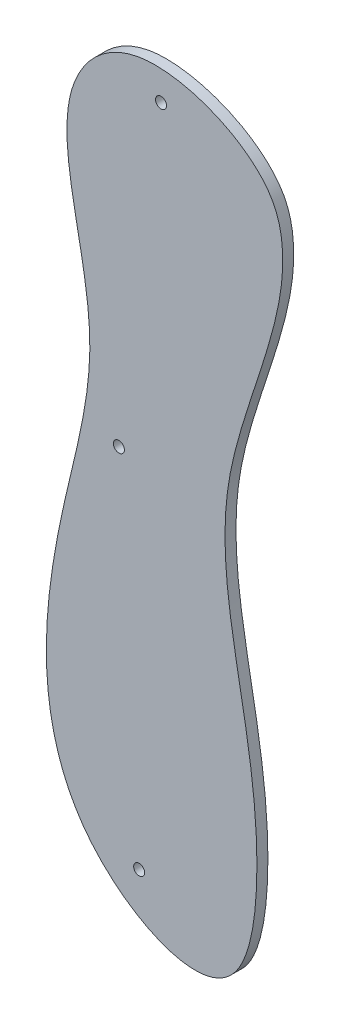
ISO-10303-21;
HEADER;
FILE_DESCRIPTION(('STEP AP214'),'2;1');
FILE_NAME('part.step','',(''),(''),'','','');
FILE_SCHEMA(('AUTOMOTIVE_DESIGN { 1 0 10303 214 1 1 1 1 }'));
ENDSEC;
DATA;
#1=APPLICATION_CONTEXT('core data for automotive mechanical design processes');
#2=APPLICATION_PROTOCOL_DEFINITION('international standard','automotive_design',2000,#1);
#3=PRODUCT_CONTEXT('',#1,'mechanical');
#4=PRODUCT('Part','Part','',(#3));
#5=PRODUCT_RELATED_PRODUCT_CATEGORY('part','',(#4));
#6=PRODUCT_DEFINITION_FORMATION('','',#4);
#7=PRODUCT_DEFINITION_CONTEXT('part definition',#1,'design');
#8=PRODUCT_DEFINITION('design','',#6,#7);
#9=PRODUCT_DEFINITION_SHAPE('','',#8);
#10=(LENGTH_UNIT() NAMED_UNIT(*) SI_UNIT(.MILLI.,.METRE.));
#11=(NAMED_UNIT(*) PLANE_ANGLE_UNIT() SI_UNIT($,.RADIAN.));
#12=(NAMED_UNIT(*) SI_UNIT($,.STERADIAN.) SOLID_ANGLE_UNIT());
#13=UNCERTAINTY_MEASURE_WITH_UNIT(LENGTH_MEASURE(1.E-05),#10,'distance_accuracy_value','');
#14=(GEOMETRIC_REPRESENTATION_CONTEXT(3) GLOBAL_UNCERTAINTY_ASSIGNED_CONTEXT((#13)) GLOBAL_UNIT_ASSIGNED_CONTEXT((#10,
#11,#12)) REPRESENTATION_CONTEXT('',''));
#15=CARTESIAN_POINT('',(0.,0.,0.));
#16=DIRECTION('',(0.,0.,1.));
#17=DIRECTION('',(1.,0.,0.));
#18=AXIS2_PLACEMENT_3D('',#15,#16,#17);
#19=CARTESIAN_POINT('',(13.0444932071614,-42.6245763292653,3.175));
#20=DIRECTION('',(0.,0.,-1.));
#21=DIRECTION('',(-1.,0.,0.));
#22=AXIS2_PLACEMENT_3D('',#19,#20,#21);
#23=PLANE('',#22);
#24=CARTESIAN_POINT('',(0.,177.8,3.175));
#25=CARTESIAN_POINT('',(-9.89367741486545,176.211861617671,3.175));
#26=CARTESIAN_POINT('',(-29.8692913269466,154.781253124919,3.175));
#27=CARTESIAN_POINT('',(-7.65316720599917,106.335029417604,3.175));
#28=CARTESIAN_POINT('',(-27.1121165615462,40.352414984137,3.175));
#29=CARTESIAN_POINT('',(-32.8005519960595,-26.0547339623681,3.175));
#30=CARTESIAN_POINT('',(31.7436827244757,-55.2962210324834,3.175));
#31=CARTESIAN_POINT('',(37.0623033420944,21.1595666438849,3.175));
#32=CARTESIAN_POINT('',(12.7066482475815,75.7713937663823,3.175));
#33=CARTESIAN_POINT('',(45.4440951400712,135.730512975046,3.175));
#34=CARTESIAN_POINT('',(37.5277986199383,170.205371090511,3.175));
#35=CARTESIAN_POINT('',(13.1508991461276,179.910989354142,3.175));
#36=CARTESIAN_POINT('',(0.,177.8,3.175));
#37=B_SPLINE_CURVE_WITH_KNOTS('',3,(#24,#25,#26,#27,#28,#29,#30,#31,#32,#33,#34,#35,#36),
.UNSPECIFIED.,.T.,.F.,(4,1,1,1,1,1,1,1,1,1,4),(0.,0.0600541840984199,0.182190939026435,
0.264365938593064,0.430401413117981,0.544580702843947,0.614929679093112,0.773981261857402,
0.897572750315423,0.920174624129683,1.),.UNSPECIFIED.);
#38=CARTESIAN_POINT('',(0.,177.8,3.175));
#39=VERTEX_POINT('',#38);
#40=EDGE_CURVE('E10',#39,#39,#37,.T.);
#41=ORIENTED_EDGE('',*,*,#40,.T.);
#42=EDGE_LOOP('',(#41));
#43=FACE_BOUND('',#42,.T.);
#44=CARTESIAN_POINT('',(6.32865157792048,169.568338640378,3.175));
#45=DIRECTION('',(0.,0.,1.));
#46=DIRECTION('',(1.,0.,0.));
#47=AXIS2_PLACEMENT_3D('',#44,#45,#46);
#48=CIRCLE('',#47,1.5875);
#49=CARTESIAN_POINT('',(7.91615157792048,169.568338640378,3.175));
#50=VERTEX_POINT('',#49);
#51=EDGE_CURVE('E52',#50,#50,#48,.T.);
#52=ORIENTED_EDGE('',*,*,#51,.F.);
#53=EDGE_LOOP('',(#52));
#54=FACE_BOUND('',#53,.T.);
#55=CARTESIAN_POINT('',(-5.85221017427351,77.2778388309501,3.175));
#56=DIRECTION('',(0.,0.,1.));
#57=DIRECTION('',(1.,0.,0.));
#58=AXIS2_PLACEMENT_3D('',#55,#56,#57);
#59=CIRCLE('',#58,1.5875);
#60=CARTESIAN_POINT('',(-4.26471017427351,77.2778388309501,3.175));
#61=VERTEX_POINT('',#60);
#62=EDGE_CURVE('E64',#61,#61,#59,.T.);
#63=ORIENTED_EDGE('',*,*,#62,.F.);
#64=EDGE_LOOP('',(#63));
#65=FACE_BOUND('',#64,.T.);
#66=CARTESIAN_POINT('',(0.,-25.7354019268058,3.175));
#67=DIRECTION('',(0.,0.,1.));
#68=DIRECTION('',(1.,0.,0.));
#69=AXIS2_PLACEMENT_3D('',#66,#67,#68);
#70=CIRCLE('',#69,1.5875);
#71=CARTESIAN_POINT('',(1.5875,-25.7354019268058,3.175));
#72=VERTEX_POINT('',#71);
#73=EDGE_CURVE('E72',#72,#72,#70,.T.);
#74=ORIENTED_EDGE('',*,*,#73,.F.);
#75=EDGE_LOOP('',(#74));
#76=FACE_BOUND('',#75,.T.);
#77=ADVANCED_FACE('F37',(#43,#54,#65,#76),#23,.F.);
#78=CARTESIAN_POINT('',(13.0444932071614,-42.6245763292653,0.));
#79=DIRECTION('',(0.,0.,-1.));
#80=DIRECTION('',(-1.,0.,0.));
#81=AXIS2_PLACEMENT_3D('',#78,#79,#80);
#82=PLANE('',#81);
#83=CARTESIAN_POINT('',(-5.85221017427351,77.2778388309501,0.));
#84=DIRECTION('',(0.,0.,1.));
#85=DIRECTION('',(1.,0.,0.));
#86=AXIS2_PLACEMENT_3D('',#83,#84,#85);
#87=CIRCLE('',#86,1.5875);
#88=CARTESIAN_POINT('',(-4.26471017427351,77.2778388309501,0.));
#89=VERTEX_POINT('',#88);
#90=EDGE_CURVE('E68',#89,#89,#87,.T.);
#91=ORIENTED_EDGE('',*,*,#90,.T.);
#92=EDGE_LOOP('',(#91));
#93=FACE_BOUND('',#92,.T.);
#94=CARTESIAN_POINT('',(0.,177.8,0.));
#95=CARTESIAN_POINT('',(-9.89367741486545,176.211861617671,0.));
#96=CARTESIAN_POINT('',(-29.8692913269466,154.781253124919,0.));
#97=CARTESIAN_POINT('',(-7.65316720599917,106.335029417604,0.));
#98=CARTESIAN_POINT('',(-27.1121165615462,40.352414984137,0.));
#99=CARTESIAN_POINT('',(-32.8005519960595,-26.0547339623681,0.));
#100=CARTESIAN_POINT('',(31.7436827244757,-55.2962210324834,0.));
#101=CARTESIAN_POINT('',(37.0623033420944,21.1595666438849,0.));
#102=CARTESIAN_POINT('',(12.7066482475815,75.7713937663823,0.));
#103=CARTESIAN_POINT('',(45.4440951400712,135.730512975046,0.));
#104=CARTESIAN_POINT('',(37.5277986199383,170.205371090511,0.));
#105=CARTESIAN_POINT('',(13.1508991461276,179.910989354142,0.));
#106=CARTESIAN_POINT('',(0.,177.8,0.));
#107=B_SPLINE_CURVE_WITH_KNOTS('',3,(#94,#95,#96,#97,#98,#99,#100,#101,#102,#103,#104,#105,
#106),.UNSPECIFIED.,.T.,.F.,(4,1,1,1,1,1,1,1,1,1,4),(0.,0.0600541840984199,0.182190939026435,
0.264365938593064,0.430401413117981,0.544580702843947,0.614929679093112,0.773981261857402,
0.897572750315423,0.920174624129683,1.),.UNSPECIFIED.);
#108=CARTESIAN_POINT('',(0.,177.8,0.));
#109=VERTEX_POINT('',#108);
#110=EDGE_CURVE('E42',#109,#109,#107,.T.);
#111=ORIENTED_EDGE('',*,*,#110,.F.);
#112=EDGE_LOOP('',(#111));
#113=FACE_BOUND('',#112,.T.);
#114=CARTESIAN_POINT('',(6.32865157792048,169.568338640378,0.));
#115=DIRECTION('',(0.,0.,1.));
#116=DIRECTION('',(1.,0.,0.));
#117=AXIS2_PLACEMENT_3D('',#114,#115,#116);
#118=CIRCLE('',#117,1.5875);
#119=CARTESIAN_POINT('',(7.91615157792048,169.568338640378,0.));
#120=VERTEX_POINT('',#119);
#121=EDGE_CURVE('E57',#120,#120,#118,.T.);
#122=ORIENTED_EDGE('',*,*,#121,.T.);
#123=EDGE_LOOP('',(#122));
#124=FACE_BOUND('',#123,.T.);
#125=CARTESIAN_POINT('',(0.,-25.7354019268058,0.));
#126=DIRECTION('',(0.,0.,1.));
#127=DIRECTION('',(1.,0.,0.));
#128=AXIS2_PLACEMENT_3D('',#125,#126,#127);
#129=CIRCLE('',#128,1.5875);
#130=CARTESIAN_POINT('',(1.5875,-25.7354019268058,0.));
#131=VERTEX_POINT('',#130);
#132=EDGE_CURVE('E76',#131,#131,#129,.T.);
#133=ORIENTED_EDGE('',*,*,#132,.T.);
#134=EDGE_LOOP('',(#133));
#135=FACE_BOUND('',#134,.T.);
#136=ADVANCED_FACE('F90',(#93,#113,#124,#135),#82,.T.);
#137=DIRECTION('',(0.,0.,-1.));
#138=VECTOR('',#137,1.);
#139=SURFACE_OF_LINEAR_EXTRUSION('',#37,#138);
#140=ORIENTED_EDGE('',*,*,#40,.F.);
#141=EDGE_LOOP('',(#140));
#142=FACE_BOUND('',#141,.T.);
#143=ORIENTED_EDGE('',*,*,#110,.T.);
#144=EDGE_LOOP('',(#143));
#145=FACE_BOUND('',#144,.T.);
#146=ADVANCED_FACE('F39',(#142,#145),#139,.F.);
#147=CARTESIAN_POINT('',(6.32865157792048,169.568338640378,3.175));
#148=DIRECTION('',(0.,0.,-1.));
#149=DIRECTION('',(-1.,0.,0.));
#150=AXIS2_PLACEMENT_3D('',#147,#148,#149);
#151=CYLINDRICAL_SURFACE('',#150,1.5875);
#152=ORIENTED_EDGE('',*,*,#51,.T.);
#153=EDGE_LOOP('',(#152));
#154=FACE_BOUND('',#153,.T.);
#155=ORIENTED_EDGE('',*,*,#121,.F.);
#156=EDGE_LOOP('',(#155));
#157=FACE_BOUND('',#156,.T.);
#158=ADVANCED_FACE('F98',(#154,#157),#151,.F.);
#159=CARTESIAN_POINT('',(-5.85221017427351,77.2778388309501,3.175));
#160=DIRECTION('',(0.,0.,-1.));
#161=DIRECTION('',(-1.,0.,0.));
#162=AXIS2_PLACEMENT_3D('',#159,#160,#161);
#163=CYLINDRICAL_SURFACE('',#162,1.5875);
#164=ORIENTED_EDGE('',*,*,#62,.T.);
#165=EDGE_LOOP('',(#164));
#166=FACE_BOUND('',#165,.T.);
#167=ORIENTED_EDGE('',*,*,#90,.F.);
#168=EDGE_LOOP('',(#167));
#169=FACE_BOUND('',#168,.T.);
#170=ADVANCED_FACE('F101',(#166,#169),#163,.F.);
#171=CARTESIAN_POINT('',(0.,-25.7354019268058,3.175));
#172=DIRECTION('',(0.,0.,-1.));
#173=DIRECTION('',(-1.,0.,0.));
#174=AXIS2_PLACEMENT_3D('',#171,#172,#173);
#175=CYLINDRICAL_SURFACE('',#174,1.5875);
#176=ORIENTED_EDGE('',*,*,#73,.T.);
#177=EDGE_LOOP('',(#176));
#178=FACE_BOUND('',#177,.T.);
#179=ORIENTED_EDGE('',*,*,#132,.F.);
#180=EDGE_LOOP('',(#179));
#181=FACE_BOUND('',#180,.T.);
#182=ADVANCED_FACE('F86',(#178,#181),#175,.F.);
#183=CLOSED_SHELL('',(#77,#136,#146,#158,#170,#182));
#184=MANIFOLD_SOLID_BREP('B2',#183);
#185=ADVANCED_BREP_SHAPE_REPRESENTATION('',(#18,#184),#14);
#186=SHAPE_DEFINITION_REPRESENTATION(#9,#185);
ENDSEC;
END-ISO-10303-21;
